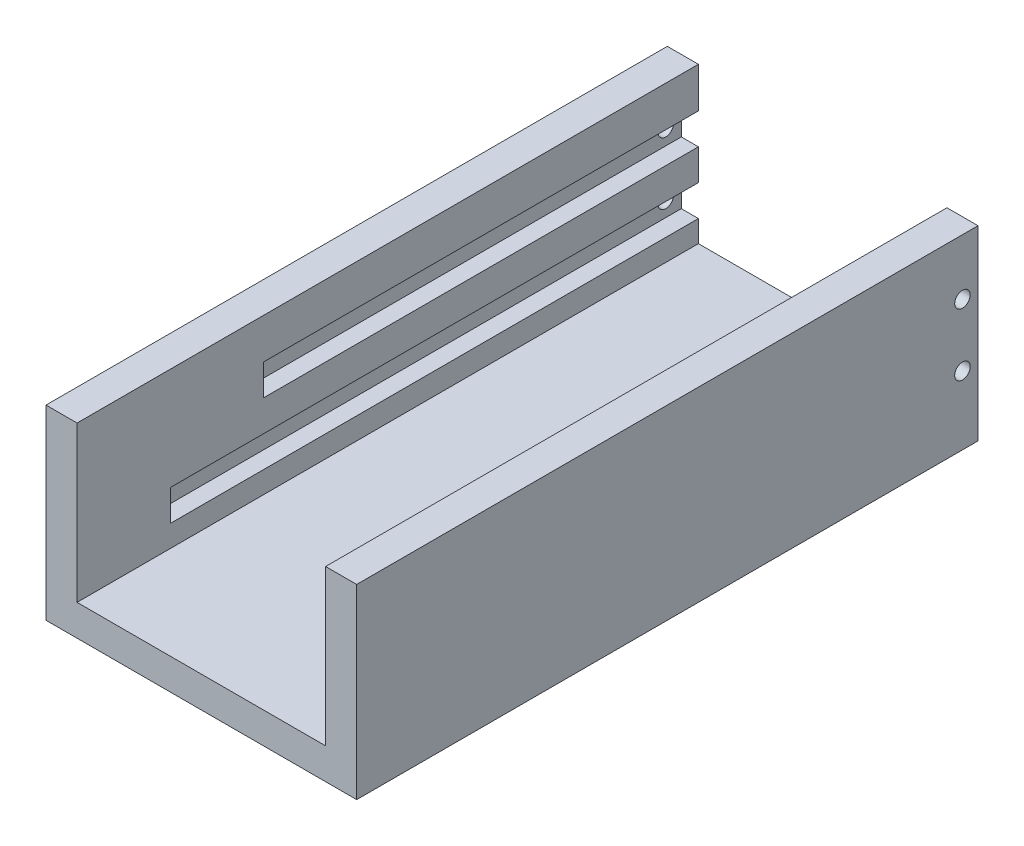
ISO-10303-21;
HEADER;
FILE_DESCRIPTION(('STEP AP214'),'2;1');
FILE_NAME('part.step','',(''),(''),'','','');
FILE_SCHEMA(('AUTOMOTIVE_DESIGN { 1 0 10303 214 1 1 1 1 }'));
ENDSEC;
DATA;
#1=APPLICATION_CONTEXT('core data for automotive mechanical design processes');
#2=APPLICATION_PROTOCOL_DEFINITION('international standard','automotive_design',2000,#1);
#3=PRODUCT_CONTEXT('',#1,'mechanical');
#4=PRODUCT('Part','Part','',(#3));
#5=PRODUCT_RELATED_PRODUCT_CATEGORY('part','',(#4));
#6=PRODUCT_DEFINITION_FORMATION('','',#4);
#7=PRODUCT_DEFINITION_CONTEXT('part definition',#1,'design');
#8=PRODUCT_DEFINITION('design','',#6,#7);
#9=PRODUCT_DEFINITION_SHAPE('','',#8);
#10=(LENGTH_UNIT() NAMED_UNIT(*) SI_UNIT(.MILLI.,.METRE.));
#11=(NAMED_UNIT(*) PLANE_ANGLE_UNIT() SI_UNIT($,.RADIAN.));
#12=(NAMED_UNIT(*) SI_UNIT($,.STERADIAN.) SOLID_ANGLE_UNIT());
#13=UNCERTAINTY_MEASURE_WITH_UNIT(LENGTH_MEASURE(1.E-05),#10,'distance_accuracy_value','');
#14=(GEOMETRIC_REPRESENTATION_CONTEXT(3) GLOBAL_UNCERTAINTY_ASSIGNED_CONTEXT((#13)) GLOBAL_UNIT_ASSIGNED_CONTEXT((#10,
#11,#12)) REPRESENTATION_CONTEXT('',''));
#15=CARTESIAN_POINT('',(0.,0.,0.));
#16=DIRECTION('',(0.,0.,1.));
#17=DIRECTION('',(1.,0.,0.));
#18=AXIS2_PLACEMENT_3D('',#15,#16,#17);
#19=CARTESIAN_POINT('',(40.,0.,200.));
#20=DIRECTION('',(1.,0.,0.));
#21=DIRECTION('',(0.,0.,-1.));
#22=AXIS2_PLACEMENT_3D('',#19,#20,#21);
#23=PLANE('',#22);
#24=DIRECTION('',(0.,0.,-1.));
#25=VECTOR('',#24,1.);
#26=CARTESIAN_POINT('',(40.,37.,0.));
#27=LINE('',#26,#25);
#28=CARTESIAN_POINT('',(40.,37.,140.));
#29=VERTEX_POINT('',#28);
#30=CARTESIAN_POINT('',(40.,37.,0.));
#31=VERTEX_POINT('',#30);
#32=EDGE_CURVE('E212',#29,#31,#27,.T.);
#33=ORIENTED_EDGE('',*,*,#32,.T.);
#34=DIRECTION('',(0.,1.,0.));
#35=VECTOR('',#34,1.);
#36=CARTESIAN_POINT('',(40.,0.,0.));
#37=LINE('',#36,#35);
#38=CARTESIAN_POINT('',(40.,27.,0.));
#39=VERTEX_POINT('',#38);
#40=EDGE_CURVE('E342',#31,#39,#37,.F.);
#41=ORIENTED_EDGE('',*,*,#40,.T.);
#42=DIRECTION('',(0.,0.,1.));
#43=VECTOR('',#42,1.);
#44=CARTESIAN_POINT('',(40.,27.,0.));
#45=LINE('',#44,#43);
#46=CARTESIAN_POINT('',(40.,27.,170.));
#47=VERTEX_POINT('',#46);
#48=EDGE_CURVE('E243',#39,#47,#45,.T.);
#49=ORIENTED_EDGE('',*,*,#48,.T.);
#50=DIRECTION('',(0.,-1.,0.));
#51=VECTOR('',#50,1.);
#52=CARTESIAN_POINT('',(40.,17.,170.));
#53=LINE('',#52,#51);
#54=CARTESIAN_POINT('',(40.,17.,170.));
#55=VERTEX_POINT('',#54);
#56=EDGE_CURVE('E240',#47,#55,#53,.T.);
#57=ORIENTED_EDGE('',*,*,#56,.T.);
#58=DIRECTION('',(0.,0.,-1.));
#59=VECTOR('',#58,1.);
#60=CARTESIAN_POINT('',(40.,17.,0.));
#61=LINE('',#60,#59);
#62=CARTESIAN_POINT('',(40.,17.,0.));
#63=VERTEX_POINT('',#62);
#64=EDGE_CURVE('E233',#55,#63,#61,.T.);
#65=ORIENTED_EDGE('',*,*,#64,.T.);
#66=CARTESIAN_POINT('',(40.,9.99999999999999,0.));
#67=VERTEX_POINT('',#66);
#68=EDGE_CURVE('E338',#63,#67,#37,.F.);
#69=ORIENTED_EDGE('',*,*,#68,.T.);
#70=DIRECTION('',(0.,0.,-1.));
#71=VECTOR('',#70,1.);
#72=CARTESIAN_POINT('',(40.,9.99999999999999,200.));
#73=LINE('',#72,#71);
#74=CARTESIAN_POINT('',(40.,9.99999999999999,200.));
#75=VERTEX_POINT('',#74);
#76=EDGE_CURVE('E368',#75,#67,#73,.T.);
#77=ORIENTED_EDGE('',*,*,#76,.F.);
#78=DIRECTION('',(0.,1.,0.));
#79=VECTOR('',#78,1.);
#80=CARTESIAN_POINT('',(40.,0.,200.));
#81=LINE('',#80,#79);
#82=CARTESIAN_POINT('',(40.,60.,200.));
#83=VERTEX_POINT('',#82);
#84=EDGE_CURVE('E361',#83,#75,#81,.F.);
#85=ORIENTED_EDGE('',*,*,#84,.F.);
#86=DIRECTION('',(0.,0.,-1.));
#87=VECTOR('',#86,1.);
#88=CARTESIAN_POINT('',(40.,60.,200.));
#89=LINE('',#88,#87);
#90=CARTESIAN_POINT('',(40.,60.,0.));
#91=VERTEX_POINT('',#90);
#92=EDGE_CURVE('E371',#83,#91,#89,.T.);
#93=ORIENTED_EDGE('',*,*,#92,.T.);
#94=CARTESIAN_POINT('',(40.,47.,0.));
#95=VERTEX_POINT('',#94);
#96=EDGE_CURVE('E339',#91,#95,#37,.F.);
#97=ORIENTED_EDGE('',*,*,#96,.T.);
#98=DIRECTION('',(0.,0.,1.));
#99=VECTOR('',#98,1.);
#100=CARTESIAN_POINT('',(40.,47.,0.));
#101=LINE('',#100,#99);
#102=CARTESIAN_POINT('',(40.,47.,140.));
#103=VERTEX_POINT('',#102);
#104=EDGE_CURVE('E221',#95,#103,#101,.T.);
#105=ORIENTED_EDGE('',*,*,#104,.T.);
#106=DIRECTION('',(0.,-1.,0.));
#107=VECTOR('',#106,1.);
#108=CARTESIAN_POINT('',(40.,37.,140.));
#109=LINE('',#108,#107);
#110=EDGE_CURVE('E202',#103,#29,#109,.T.);
#111=ORIENTED_EDGE('',*,*,#110,.T.);
#112=EDGE_LOOP('',(#33,#41,#49,#57,#65,#69,#77,#85,#93,#97,#105,#111));
#113=FACE_BOUND('',#112,.T.);
#114=ADVANCED_FACE('F33',(#113),#23,.F.);
#115=CARTESIAN_POINT('',(-40.,60.,0.));
#116=DIRECTION('',(0.,0.,-1.));
#117=DIRECTION('',(-1.,0.,0.));
#118=AXIS2_PLACEMENT_3D('',#115,#116,#117);
#119=PLANE('',#118);
#120=ORIENTED_EDGE('',*,*,#40,.F.);
#121=DIRECTION('',(-1.,0.,0.));
#122=VECTOR('',#121,1.);
#123=CARTESIAN_POINT('',(45.5,37.,0.));
#124=LINE('',#123,#122);
#125=CARTESIAN_POINT('',(45.5,37.,0.));
#126=VERTEX_POINT('',#125);
#127=EDGE_CURVE('E215',#126,#31,#124,.T.);
#128=ORIENTED_EDGE('',*,*,#127,.F.);
#129=DIRECTION('',(0.,1.,0.));
#130=VECTOR('',#129,1.);
#131=CARTESIAN_POINT('',(45.5,47.,0.));
#132=LINE('',#131,#130);
#133=CARTESIAN_POINT('',(45.5,47.,0.));
#134=VERTEX_POINT('',#133);
#135=EDGE_CURVE('E209',#126,#134,#132,.T.);
#136=ORIENTED_EDGE('',*,*,#135,.T.);
#137=DIRECTION('',(-1.,0.,0.));
#138=VECTOR('',#137,1.);
#139=CARTESIAN_POINT('',(45.5,47.,0.));
#140=LINE('',#139,#138);
#141=EDGE_CURVE('E234',#134,#95,#140,.T.);
#142=ORIENTED_EDGE('',*,*,#141,.T.);
#143=ORIENTED_EDGE('',*,*,#96,.F.);
#144=DIRECTION('',(1.,0.,0.));
#145=VECTOR('',#144,1.);
#146=CARTESIAN_POINT('',(40.,60.,0.));
#147=LINE('',#146,#145);
#148=CARTESIAN_POINT('',(50.,60.,0.));
#149=VERTEX_POINT('',#148);
#150=EDGE_CURVE('E335',#91,#149,#147,.T.);
#151=ORIENTED_EDGE('',*,*,#150,.T.);
#152=DIRECTION('',(0.,-1.,0.));
#153=VECTOR('',#152,1.);
#154=CARTESIAN_POINT('',(50.,0.,0.));
#155=LINE('',#154,#153);
#156=CARTESIAN_POINT('',(50.,0.,0.));
#157=VERTEX_POINT('',#156);
#158=EDGE_CURVE('E332',#149,#157,#155,.T.);
#159=ORIENTED_EDGE('',*,*,#158,.T.);
#160=DIRECTION('',(-1.,0.,0.));
#161=VECTOR('',#160,1.);
#162=CARTESIAN_POINT('',(50.,0.,0.));
#163=LINE('',#162,#161);
#164=CARTESIAN_POINT('',(-50.,0.,0.));
#165=VERTEX_POINT('',#164);
#166=EDGE_CURVE('E329',#157,#165,#163,.T.);
#167=ORIENTED_EDGE('',*,*,#166,.T.);
#168=DIRECTION('',(0.,1.,0.));
#169=VECTOR('',#168,1.);
#170=CARTESIAN_POINT('',(-50.,0.,0.));
#171=LINE('',#170,#169);
#172=CARTESIAN_POINT('',(-50.,60.,0.));
#173=VERTEX_POINT('',#172);
#174=EDGE_CURVE('E326',#165,#173,#171,.T.);
#175=ORIENTED_EDGE('',*,*,#174,.T.);
#176=DIRECTION('',(1.,0.,0.));
#177=VECTOR('',#176,1.);
#178=CARTESIAN_POINT('',(-50.,60.,0.));
#179=LINE('',#178,#177);
#180=CARTESIAN_POINT('',(-40.,60.,0.));
#181=VERTEX_POINT('',#180);
#182=EDGE_CURVE('E322',#173,#181,#179,.T.);
#183=ORIENTED_EDGE('',*,*,#182,.T.);
#184=DIRECTION('',(0.,1.,0.));
#185=VECTOR('',#184,1.);
#186=CARTESIAN_POINT('',(-40.,0.,0.));
#187=LINE('',#186,#185);
#188=CARTESIAN_POINT('',(-40.,47.,0.));
#189=VERTEX_POINT('',#188);
#190=EDGE_CURVE('E313',#189,#181,#187,.T.);
#191=ORIENTED_EDGE('',*,*,#190,.F.);
#192=DIRECTION('',(1.,0.,0.));
#193=VECTOR('',#192,1.);
#194=CARTESIAN_POINT('',(-45.5,47.,0.));
#195=LINE('',#194,#193);
#196=CARTESIAN_POINT('',(-45.5,47.,0.));
#197=VERTEX_POINT('',#196);
#198=EDGE_CURVE('E287',#197,#189,#195,.T.);
#199=ORIENTED_EDGE('',*,*,#198,.F.);
#200=DIRECTION('',(0.,1.,0.));
#201=VECTOR('',#200,1.);
#202=CARTESIAN_POINT('',(-45.5,47.,0.));
#203=LINE('',#202,#201);
#204=CARTESIAN_POINT('',(-45.5,37.,0.));
#205=VERTEX_POINT('',#204);
#206=EDGE_CURVE('E272',#205,#197,#203,.T.);
#207=ORIENTED_EDGE('',*,*,#206,.F.);
#208=DIRECTION('',(1.,0.,0.));
#209=VECTOR('',#208,1.);
#210=CARTESIAN_POINT('',(-45.5,37.,0.));
#211=LINE('',#210,#209);
#212=CARTESIAN_POINT('',(-40.,37.,0.));
#213=VERTEX_POINT('',#212);
#214=EDGE_CURVE('E281',#205,#213,#211,.T.);
#215=ORIENTED_EDGE('',*,*,#214,.T.);
#216=CARTESIAN_POINT('',(-40.,27.,0.));
#217=VERTEX_POINT('',#216);
#218=EDGE_CURVE('E323',#217,#213,#187,.T.);
#219=ORIENTED_EDGE('',*,*,#218,.F.);
#220=DIRECTION('',(1.,0.,0.));
#221=VECTOR('',#220,1.);
#222=CARTESIAN_POINT('',(-45.5,27.,0.));
#223=LINE('',#222,#221);
#224=CARTESIAN_POINT('',(-45.5,27.,0.));
#225=VERTEX_POINT('',#224);
#226=EDGE_CURVE('E309',#225,#217,#223,.T.);
#227=ORIENTED_EDGE('',*,*,#226,.F.);
#228=DIRECTION('',(0.,1.,0.));
#229=VECTOR('',#228,1.);
#230=CARTESIAN_POINT('',(-45.5,27.,0.));
#231=LINE('',#230,#229);
#232=CARTESIAN_POINT('',(-45.5,17.,0.));
#233=VERTEX_POINT('',#232);
#234=EDGE_CURVE('E298',#233,#225,#231,.T.);
#235=ORIENTED_EDGE('',*,*,#234,.F.);
#236=DIRECTION('',(1.,0.,0.));
#237=VECTOR('',#236,1.);
#238=CARTESIAN_POINT('',(-45.5,17.,0.));
#239=LINE('',#238,#237);
#240=CARTESIAN_POINT('',(-40.,17.,0.));
#241=VERTEX_POINT('',#240);
#242=EDGE_CURVE('E310',#233,#241,#239,.T.);
#243=ORIENTED_EDGE('',*,*,#242,.T.);
#244=CARTESIAN_POINT('',(-40.,9.99999999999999,0.));
#245=VERTEX_POINT('',#244);
#246=EDGE_CURVE('E319',#245,#241,#187,.T.);
#247=ORIENTED_EDGE('',*,*,#246,.F.);
#248=DIRECTION('',(1.,0.,0.));
#249=VECTOR('',#248,1.);
#250=CARTESIAN_POINT('',(50.,9.99999999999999,0.));
#251=LINE('',#250,#249);
#252=EDGE_CURVE('E341',#67,#245,#251,.F.);
#253=ORIENTED_EDGE('',*,*,#252,.F.);
#254=ORIENTED_EDGE('',*,*,#68,.F.);
#255=DIRECTION('',(-1.,0.,0.));
#256=VECTOR('',#255,1.);
#257=CARTESIAN_POINT('',(45.5,17.,0.));
#258=LINE('',#257,#256);
#259=CARTESIAN_POINT('',(45.5,17.,0.));
#260=VERTEX_POINT('',#259);
#261=EDGE_CURVE('E255',#260,#63,#258,.T.);
#262=ORIENTED_EDGE('',*,*,#261,.F.);
#263=DIRECTION('',(0.,1.,0.));
#264=VECTOR('',#263,1.);
#265=CARTESIAN_POINT('',(45.5,27.,0.));
#266=LINE('',#265,#264);
#267=CARTESIAN_POINT('',(45.5,27.,0.));
#268=VERTEX_POINT('',#267);
#269=EDGE_CURVE('E246',#260,#268,#266,.T.);
#270=ORIENTED_EDGE('',*,*,#269,.T.);
#271=DIRECTION('',(-1.,0.,0.));
#272=VECTOR('',#271,1.);
#273=CARTESIAN_POINT('',(45.5,27.,0.));
#274=LINE('',#273,#272);
#275=EDGE_CURVE('E58',#268,#39,#274,.T.);
#276=ORIENTED_EDGE('',*,*,#275,.T.);
#277=EDGE_LOOP('',(#120,#128,#136,#142,#143,#151,#159,#167,#175,#183,#191,#199,#207,#215,#219,
#227,#235,#243,#247,#253,#254,#262,#270,#276));
#278=FACE_BOUND('',#277,.T.);
#279=ADVANCED_FACE('F420',(#278),#119,.T.);
#280=CARTESIAN_POINT('',(-40.,0.,200.));
#281=DIRECTION('',(-1.,0.,0.));
#282=DIRECTION('',(0.,0.,1.));
#283=AXIS2_PLACEMENT_3D('',#280,#281,#282);
#284=PLANE('',#283);
#285=ORIENTED_EDGE('',*,*,#218,.T.);
#286=DIRECTION('',(0.,0.,-1.));
#287=VECTOR('',#286,1.);
#288=CARTESIAN_POINT('',(-40.,37.,0.));
#289=LINE('',#288,#287);
#290=CARTESIAN_POINT('',(-40.,37.,140.));
#291=VERTEX_POINT('',#290);
#292=EDGE_CURVE('E257',#291,#213,#289,.T.);
#293=ORIENTED_EDGE('',*,*,#292,.F.);
#294=DIRECTION('',(0.,-1.,0.));
#295=VECTOR('',#294,1.);
#296=CARTESIAN_POINT('',(-40.,37.,140.));
#297=LINE('',#296,#295);
#298=CARTESIAN_POINT('',(-40.,47.,140.));
#299=VERTEX_POINT('',#298);
#300=EDGE_CURVE('E267',#299,#291,#297,.T.);
#301=ORIENTED_EDGE('',*,*,#300,.F.);
#302=DIRECTION('',(0.,0.,1.));
#303=VECTOR('',#302,1.);
#304=CARTESIAN_POINT('',(-40.,47.,0.));
#305=LINE('',#304,#303);
#306=EDGE_CURVE('E264',#189,#299,#305,.T.);
#307=ORIENTED_EDGE('',*,*,#306,.F.);
#308=ORIENTED_EDGE('',*,*,#190,.T.);
#309=DIRECTION('',(0.,0.,-1.));
#310=VECTOR('',#309,1.);
#311=CARTESIAN_POINT('',(-40.,60.,200.));
#312=LINE('',#311,#310);
#313=CARTESIAN_POINT('',(-40.,60.,200.));
#314=VERTEX_POINT('',#313);
#315=EDGE_CURVE('E11',#314,#181,#312,.T.);
#316=ORIENTED_EDGE('',*,*,#315,.F.);
#317=DIRECTION('',(0.,1.,0.));
#318=VECTOR('',#317,1.);
#319=CARTESIAN_POINT('',(-40.,0.,200.));
#320=LINE('',#319,#318);
#321=CARTESIAN_POINT('',(-40.,9.99999999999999,200.));
#322=VERTEX_POINT('',#321);
#323=EDGE_CURVE('E344',#322,#314,#320,.T.);
#324=ORIENTED_EDGE('',*,*,#323,.F.);
#325=DIRECTION('',(0.,0.,-1.));
#326=VECTOR('',#325,1.);
#327=CARTESIAN_POINT('',(-40.,9.99999999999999,200.));
#328=LINE('',#327,#326);
#329=EDGE_CURVE('E365',#322,#245,#328,.T.);
#330=ORIENTED_EDGE('',*,*,#329,.T.);
#331=ORIENTED_EDGE('',*,*,#246,.T.);
#332=DIRECTION('',(0.,0.,-1.));
#333=VECTOR('',#332,1.);
#334=CARTESIAN_POINT('',(-40.,17.,0.));
#335=LINE('',#334,#333);
#336=CARTESIAN_POINT('',(-40.,17.,170.));
#337=VERTEX_POINT('',#336);
#338=EDGE_CURVE('E296',#337,#241,#335,.T.);
#339=ORIENTED_EDGE('',*,*,#338,.F.);
#340=DIRECTION('',(0.,-1.,0.));
#341=VECTOR('',#340,1.);
#342=CARTESIAN_POINT('',(-40.,17.,170.));
#343=LINE('',#342,#341);
#344=CARTESIAN_POINT('',(-40.,27.,170.));
#345=VERTEX_POINT('',#344);
#346=EDGE_CURVE('E293',#345,#337,#343,.T.);
#347=ORIENTED_EDGE('',*,*,#346,.F.);
#348=DIRECTION('',(0.,0.,1.));
#349=VECTOR('',#348,1.);
#350=CARTESIAN_POINT('',(-40.,27.,0.));
#351=LINE('',#350,#349);
#352=EDGE_CURVE('E284',#217,#345,#351,.T.);
#353=ORIENTED_EDGE('',*,*,#352,.F.);
#354=EDGE_LOOP('',(#285,#293,#301,#307,#308,#316,#324,#330,#331,#339,#347,#353));
#355=FACE_BOUND('',#354,.T.);
#356=ADVANCED_FACE('F35',(#355),#284,.F.);
#357=CARTESIAN_POINT('',(-50.,60.,200.));
#358=DIRECTION('',(0.,1.,0.));
#359=DIRECTION('',(0.,0.,1.));
#360=AXIS2_PLACEMENT_3D('',#357,#358,#359);
#361=PLANE('',#360);
#362=ORIENTED_EDGE('',*,*,#182,.F.);
#363=DIRECTION('',(0.,0.,-1.));
#364=VECTOR('',#363,1.);
#365=CARTESIAN_POINT('',(-50.,60.,200.));
#366=LINE('',#365,#364);
#367=CARTESIAN_POINT('',(-50.,60.,200.));
#368=VERTEX_POINT('',#367);
#369=EDGE_CURVE('E42',#368,#173,#366,.T.);
#370=ORIENTED_EDGE('',*,*,#369,.F.);
#371=DIRECTION('',(1.,0.,0.));
#372=VECTOR('',#371,1.);
#373=CARTESIAN_POINT('',(-50.,60.,200.));
#374=LINE('',#373,#372);
#375=EDGE_CURVE('E346',#368,#314,#374,.T.);
#376=ORIENTED_EDGE('',*,*,#375,.T.);
#377=ORIENTED_EDGE('',*,*,#315,.T.);
#378=EDGE_LOOP('',(#362,#370,#376,#377));
#379=FACE_BOUND('',#378,.T.);
#380=ADVANCED_FACE('F437',(#379),#361,.T.);
#381=CARTESIAN_POINT('',(-50.,0.,200.));
#382=DIRECTION('',(-1.,0.,0.));
#383=DIRECTION('',(0.,0.,1.));
#384=AXIS2_PLACEMENT_3D('',#381,#382,#383);
#385=PLANE('',#384);
#386=CARTESIAN_POINT('',(-50.,22.,5.));
#387=DIRECTION('',(1.,0.,0.));
#388=DIRECTION('',(0.,0.,-1.));
#389=AXIS2_PLACEMENT_3D('',#386,#387,#388);
#390=CIRCLE('',#389,2.5);
#391=CARTESIAN_POINT('',(-50.,22.,2.5));
#392=VERTEX_POINT('',#391);
#393=EDGE_CURVE('E396',#392,#392,#390,.T.);
#394=ORIENTED_EDGE('',*,*,#393,.T.);
#395=EDGE_LOOP('',(#394));
#396=FACE_BOUND('',#395,.T.);
#397=CARTESIAN_POINT('',(-50.,42.,5.));
#398=DIRECTION('',(1.,0.,0.));
#399=DIRECTION('',(0.,0.,-1.));
#400=AXIS2_PLACEMENT_3D('',#397,#398,#399);
#401=CIRCLE('',#400,2.5);
#402=CARTESIAN_POINT('',(-50.,42.,2.5));
#403=VERTEX_POINT('',#402);
#404=EDGE_CURVE('E381',#403,#403,#401,.T.);
#405=ORIENTED_EDGE('',*,*,#404,.T.);
#406=EDGE_LOOP('',(#405));
#407=FACE_BOUND('',#406,.T.);
#408=ORIENTED_EDGE('',*,*,#174,.F.);
#409=DIRECTION('',(0.,0.,-1.));
#410=VECTOR('',#409,1.);
#411=CARTESIAN_POINT('',(-50.,0.,200.));
#412=LINE('',#411,#410);
#413=CARTESIAN_POINT('',(-50.,0.,200.));
#414=VERTEX_POINT('',#413);
#415=EDGE_CURVE('E377',#414,#165,#412,.T.);
#416=ORIENTED_EDGE('',*,*,#415,.F.);
#417=DIRECTION('',(0.,1.,0.));
#418=VECTOR('',#417,1.);
#419=CARTESIAN_POINT('',(-50.,0.,200.));
#420=LINE('',#419,#418);
#421=EDGE_CURVE('E349',#414,#368,#420,.T.);
#422=ORIENTED_EDGE('',*,*,#421,.T.);
#423=ORIENTED_EDGE('',*,*,#369,.T.);
#424=EDGE_LOOP('',(#408,#416,#422,#423));
#425=FACE_BOUND('',#424,.T.);
#426=ADVANCED_FACE('F435',(#396,#407,#425),#385,.T.);
#427=CARTESIAN_POINT('',(50.,0.,200.));
#428=DIRECTION('',(0.,-1.,0.));
#429=DIRECTION('',(0.,0.,-1.));
#430=AXIS2_PLACEMENT_3D('',#427,#428,#429);
#431=PLANE('',#430);
#432=ORIENTED_EDGE('',*,*,#166,.F.);
#433=DIRECTION('',(0.,0.,-1.));
#434=VECTOR('',#433,1.);
#435=CARTESIAN_POINT('',(50.,0.,200.));
#436=LINE('',#435,#434);
#437=CARTESIAN_POINT('',(50.,0.,200.));
#438=VERTEX_POINT('',#437);
#439=EDGE_CURVE('E375',#438,#157,#436,.T.);
#440=ORIENTED_EDGE('',*,*,#439,.F.);
#441=DIRECTION('',(-1.,0.,0.));
#442=VECTOR('',#441,1.);
#443=CARTESIAN_POINT('',(50.,0.,200.));
#444=LINE('',#443,#442);
#445=EDGE_CURVE('E352',#438,#414,#444,.T.);
#446=ORIENTED_EDGE('',*,*,#445,.T.);
#447=ORIENTED_EDGE('',*,*,#415,.T.);
#448=EDGE_LOOP('',(#432,#440,#446,#447));
#449=FACE_BOUND('',#448,.T.);
#450=ADVANCED_FACE('F410',(#449),#431,.T.);
#451=CARTESIAN_POINT('',(50.,0.,200.));
#452=DIRECTION('',(1.,0.,0.));
#453=DIRECTION('',(0.,0.,-1.));
#454=AXIS2_PLACEMENT_3D('',#451,#452,#453);
#455=PLANE('',#454);
#456=CARTESIAN_POINT('',(50.,22.,5.));
#457=DIRECTION('',(1.,0.,0.));
#458=DIRECTION('',(0.,0.,-1.));
#459=AXIS2_PLACEMENT_3D('',#456,#457,#458);
#460=CIRCLE('',#459,2.5);
#461=CARTESIAN_POINT('',(50.,22.,2.5));
#462=VERTEX_POINT('',#461);
#463=EDGE_CURVE('E399',#462,#462,#460,.T.);
#464=ORIENTED_EDGE('',*,*,#463,.F.);
#465=EDGE_LOOP('',(#464));
#466=FACE_BOUND('',#465,.T.);
#467=CARTESIAN_POINT('',(50.,42.,5.));
#468=DIRECTION('',(1.,0.,0.));
#469=DIRECTION('',(0.,0.,-1.));
#470=AXIS2_PLACEMENT_3D('',#467,#468,#469);
#471=CIRCLE('',#470,2.5);
#472=CARTESIAN_POINT('',(50.,42.,2.5));
#473=VERTEX_POINT('',#472);
#474=EDGE_CURVE('E386',#473,#473,#471,.T.);
#475=ORIENTED_EDGE('',*,*,#474,.F.);
#476=EDGE_LOOP('',(#475));
#477=FACE_BOUND('',#476,.T.);
#478=ORIENTED_EDGE('',*,*,#158,.F.);
#479=DIRECTION('',(0.,0.,-1.));
#480=VECTOR('',#479,1.);
#481=CARTESIAN_POINT('',(50.,60.,200.));
#482=LINE('',#481,#480);
#483=CARTESIAN_POINT('',(50.,60.,200.));
#484=VERTEX_POINT('',#483);
#485=EDGE_CURVE('E373',#484,#149,#482,.T.);
#486=ORIENTED_EDGE('',*,*,#485,.F.);
#487=DIRECTION('',(0.,-1.,0.));
#488=VECTOR('',#487,1.);
#489=CARTESIAN_POINT('',(50.,0.,200.));
#490=LINE('',#489,#488);
#491=EDGE_CURVE('E355',#484,#438,#490,.T.);
#492=ORIENTED_EDGE('',*,*,#491,.T.);
#493=ORIENTED_EDGE('',*,*,#439,.T.);
#494=EDGE_LOOP('',(#478,#486,#492,#493));
#495=FACE_BOUND('',#494,.T.);
#496=ADVANCED_FACE('F406',(#466,#477,#495),#455,.T.);
#497=CARTESIAN_POINT('',(40.,60.,200.));
#498=DIRECTION('',(0.,1.,0.));
#499=DIRECTION('',(0.,0.,1.));
#500=AXIS2_PLACEMENT_3D('',#497,#498,#499);
#501=PLANE('',#500);
#502=ORIENTED_EDGE('',*,*,#150,.F.);
#503=ORIENTED_EDGE('',*,*,#92,.F.);
#504=DIRECTION('',(1.,0.,0.));
#505=VECTOR('',#504,1.);
#506=CARTESIAN_POINT('',(40.,60.,200.));
#507=LINE('',#506,#505);
#508=EDGE_CURVE('E358',#83,#484,#507,.T.);
#509=ORIENTED_EDGE('',*,*,#508,.T.);
#510=ORIENTED_EDGE('',*,*,#485,.T.);
#511=EDGE_LOOP('',(#502,#503,#509,#510));
#512=FACE_BOUND('',#511,.T.);
#513=ADVANCED_FACE('F409',(#512),#501,.T.);
#514=CARTESIAN_POINT('',(50.,9.99999999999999,200.));
#515=DIRECTION('',(0.,-1.,0.));
#516=DIRECTION('',(0.,0.,-1.));
#517=AXIS2_PLACEMENT_3D('',#514,#515,#516);
#518=PLANE('',#517);
#519=ORIENTED_EDGE('',*,*,#252,.T.);
#520=ORIENTED_EDGE('',*,*,#329,.F.);
#521=DIRECTION('',(1.,0.,0.));
#522=VECTOR('',#521,1.);
#523=CARTESIAN_POINT('',(50.,9.99999999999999,200.));
#524=LINE('',#523,#522);
#525=EDGE_CURVE('E363',#75,#322,#524,.F.);
#526=ORIENTED_EDGE('',*,*,#525,.F.);
#527=ORIENTED_EDGE('',*,*,#76,.T.);
#528=EDGE_LOOP('',(#519,#520,#526,#527));
#529=FACE_BOUND('',#528,.T.);
#530=ADVANCED_FACE('F485',(#529),#518,.F.);
#531=CARTESIAN_POINT('',(-40.,60.,200.));
#532=DIRECTION('',(0.,0.,-1.));
#533=DIRECTION('',(-1.,0.,0.));
#534=AXIS2_PLACEMENT_3D('',#531,#532,#533);
#535=PLANE('',#534);
#536=ORIENTED_EDGE('',*,*,#323,.T.);
#537=ORIENTED_EDGE('',*,*,#375,.F.);
#538=ORIENTED_EDGE('',*,*,#421,.F.);
#539=ORIENTED_EDGE('',*,*,#445,.F.);
#540=ORIENTED_EDGE('',*,*,#491,.F.);
#541=ORIENTED_EDGE('',*,*,#508,.F.);
#542=ORIENTED_EDGE('',*,*,#84,.T.);
#543=ORIENTED_EDGE('',*,*,#525,.T.);
#544=EDGE_LOOP('',(#536,#537,#538,#539,#540,#541,#542,#543));
#545=FACE_BOUND('',#544,.T.);
#546=ADVANCED_FACE('F425',(#545),#535,.F.);
#547=CARTESIAN_POINT('',(-45.5,17.,0.));
#548=DIRECTION('',(0.,-1.,0.));
#549=DIRECTION('',(0.,0.,-1.));
#550=AXIS2_PLACEMENT_3D('',#547,#548,#549);
#551=PLANE('',#550);
#552=ORIENTED_EDGE('',*,*,#338,.T.);
#553=ORIENTED_EDGE('',*,*,#242,.F.);
#554=DIRECTION('',(0.,0.,-1.));
#555=VECTOR('',#554,1.);
#556=CARTESIAN_POINT('',(-45.5,17.,0.));
#557=LINE('',#556,#555);
#558=CARTESIAN_POINT('',(-45.5,17.,170.));
#559=VERTEX_POINT('',#558);
#560=EDGE_CURVE('E307',#559,#233,#557,.T.);
#561=ORIENTED_EDGE('',*,*,#560,.F.);
#562=DIRECTION('',(1.,0.,0.));
#563=VECTOR('',#562,1.);
#564=CARTESIAN_POINT('',(-45.5,17.,170.));
#565=LINE('',#564,#563);
#566=EDGE_CURVE('E314',#559,#337,#565,.T.);
#567=ORIENTED_EDGE('',*,*,#566,.T.);
#568=EDGE_LOOP('',(#552,#553,#561,#567));
#569=FACE_BOUND('',#568,.T.);
#570=ADVANCED_FACE('F679',(#569),#551,.F.);
#571=CARTESIAN_POINT('',(-45.5,17.,170.));
#572=DIRECTION('',(0.,0.,1.));
#573=DIRECTION('',(1.,0.,0.));
#574=AXIS2_PLACEMENT_3D('',#571,#572,#573);
#575=PLANE('',#574);
#576=ORIENTED_EDGE('',*,*,#346,.T.);
#577=ORIENTED_EDGE('',*,*,#566,.F.);
#578=DIRECTION('',(0.,-1.,0.));
#579=VECTOR('',#578,1.);
#580=CARTESIAN_POINT('',(-45.5,17.,170.));
#581=LINE('',#580,#579);
#582=CARTESIAN_POINT('',(-45.5,27.,170.));
#583=VERTEX_POINT('',#582);
#584=EDGE_CURVE('E304',#583,#559,#581,.T.);
#585=ORIENTED_EDGE('',*,*,#584,.F.);
#586=DIRECTION('',(1.,0.,0.));
#587=VECTOR('',#586,1.);
#588=CARTESIAN_POINT('',(-45.5,27.,170.));
#589=LINE('',#588,#587);
#590=EDGE_CURVE('E316',#583,#345,#589,.T.);
#591=ORIENTED_EDGE('',*,*,#590,.T.);
#592=EDGE_LOOP('',(#576,#577,#585,#591));
#593=FACE_BOUND('',#592,.T.);
#594=ADVANCED_FACE('F682',(#593),#575,.F.);
#595=CARTESIAN_POINT('',(-45.5,27.,0.));
#596=DIRECTION('',(0.,1.,0.));
#597=DIRECTION('',(0.,0.,1.));
#598=AXIS2_PLACEMENT_3D('',#595,#596,#597);
#599=PLANE('',#598);
#600=ORIENTED_EDGE('',*,*,#352,.T.);
#601=ORIENTED_EDGE('',*,*,#590,.F.);
#602=DIRECTION('',(0.,0.,1.));
#603=VECTOR('',#602,1.);
#604=CARTESIAN_POINT('',(-45.5,27.,0.));
#605=LINE('',#604,#603);
#606=EDGE_CURVE('E301',#225,#583,#605,.T.);
#607=ORIENTED_EDGE('',*,*,#606,.F.);
#608=ORIENTED_EDGE('',*,*,#226,.T.);
#609=EDGE_LOOP('',(#600,#601,#607,#608));
#610=FACE_BOUND('',#609,.T.);
#611=ADVANCED_FACE('F589',(#610),#599,.F.);
#612=CARTESIAN_POINT('',(-45.5,17.,0.));
#613=DIRECTION('',(-1.,0.,0.));
#614=DIRECTION('',(0.,0.,1.));
#615=AXIS2_PLACEMENT_3D('',#612,#613,#614);
#616=PLANE('',#615);
#617=CARTESIAN_POINT('',(-45.5,22.,5.));
#618=DIRECTION('',(-1.,0.,0.));
#619=DIRECTION('',(0.,0.,1.));
#620=AXIS2_PLACEMENT_3D('',#617,#618,#619);
#621=CIRCLE('',#620,2.5);
#622=CARTESIAN_POINT('',(-45.5,22.,7.5));
#623=VERTEX_POINT('',#622);
#624=EDGE_CURVE('E391',#623,#623,#621,.T.);
#625=ORIENTED_EDGE('',*,*,#624,.T.);
#626=EDGE_LOOP('',(#625));
#627=FACE_BOUND('',#626,.T.);
#628=ORIENTED_EDGE('',*,*,#234,.T.);
#629=ORIENTED_EDGE('',*,*,#606,.T.);
#630=ORIENTED_EDGE('',*,*,#584,.T.);
#631=ORIENTED_EDGE('',*,*,#560,.T.);
#632=EDGE_LOOP('',(#628,#629,#630,#631));
#633=FACE_BOUND('',#632,.T.);
#634=ADVANCED_FACE('F585',(#627,#633),#616,.F.);
#635=CARTESIAN_POINT('',(-45.5,37.,0.));
#636=DIRECTION('',(0.,-1.,0.));
#637=DIRECTION('',(0.,0.,-1.));
#638=AXIS2_PLACEMENT_3D('',#635,#636,#637);
#639=PLANE('',#638);
#640=ORIENTED_EDGE('',*,*,#292,.T.);
#641=ORIENTED_EDGE('',*,*,#214,.F.);
#642=DIRECTION('',(0.,0.,-1.));
#643=VECTOR('',#642,1.);
#644=CARTESIAN_POINT('',(-45.5,37.,0.));
#645=LINE('',#644,#643);
#646=CARTESIAN_POINT('',(-45.5,37.,140.));
#647=VERTEX_POINT('',#646);
#648=EDGE_CURVE('E270',#647,#205,#645,.T.);
#649=ORIENTED_EDGE('',*,*,#648,.F.);
#650=DIRECTION('',(1.,0.,0.));
#651=VECTOR('',#650,1.);
#652=CARTESIAN_POINT('',(-45.5,37.,140.));
#653=LINE('',#652,#651);
#654=EDGE_CURVE('E282',#647,#291,#653,.T.);
#655=ORIENTED_EDGE('',*,*,#654,.T.);
#656=EDGE_LOOP('',(#640,#641,#649,#655));
#657=FACE_BOUND('',#656,.T.);
#658=ADVANCED_FACE('F455',(#657),#639,.F.);
#659=CARTESIAN_POINT('',(-45.5,37.,140.));
#660=DIRECTION('',(0.,0.,1.));
#661=DIRECTION('',(1.,0.,0.));
#662=AXIS2_PLACEMENT_3D('',#659,#660,#661);
#663=PLANE('',#662);
#664=ORIENTED_EDGE('',*,*,#300,.T.);
#665=ORIENTED_EDGE('',*,*,#654,.F.);
#666=DIRECTION('',(0.,-1.,0.));
#667=VECTOR('',#666,1.);
#668=CARTESIAN_POINT('',(-45.5,37.,140.));
#669=LINE('',#668,#667);
#670=CARTESIAN_POINT('',(-45.5,47.,140.));
#671=VERTEX_POINT('',#670);
#672=EDGE_CURVE('E278',#671,#647,#669,.T.);
#673=ORIENTED_EDGE('',*,*,#672,.F.);
#674=DIRECTION('',(1.,0.,0.));
#675=VECTOR('',#674,1.);
#676=CARTESIAN_POINT('',(-45.5,47.,140.));
#677=LINE('',#676,#675);
#678=EDGE_CURVE('E285',#671,#299,#677,.T.);
#679=ORIENTED_EDGE('',*,*,#678,.T.);
#680=EDGE_LOOP('',(#664,#665,#673,#679));
#681=FACE_BOUND('',#680,.T.);
#682=ADVANCED_FACE('F458',(#681),#663,.F.);
#683=CARTESIAN_POINT('',(-45.5,47.,0.));
#684=DIRECTION('',(0.,1.,0.));
#685=DIRECTION('',(0.,0.,1.));
#686=AXIS2_PLACEMENT_3D('',#683,#684,#685);
#687=PLANE('',#686);
#688=ORIENTED_EDGE('',*,*,#306,.T.);
#689=ORIENTED_EDGE('',*,*,#678,.F.);
#690=DIRECTION('',(0.,0.,1.));
#691=VECTOR('',#690,1.);
#692=CARTESIAN_POINT('',(-45.5,47.,0.));
#693=LINE('',#692,#691);
#694=EDGE_CURVE('E275',#197,#671,#693,.T.);
#695=ORIENTED_EDGE('',*,*,#694,.F.);
#696=ORIENTED_EDGE('',*,*,#198,.T.);
#697=EDGE_LOOP('',(#688,#689,#695,#696));
#698=FACE_BOUND('',#697,.T.);
#699=ADVANCED_FACE('F460',(#698),#687,.F.);
#700=CARTESIAN_POINT('',(-45.5,37.,0.));
#701=DIRECTION('',(1.,0.,0.));
#702=DIRECTION('',(0.,0.,-1.));
#703=AXIS2_PLACEMENT_3D('',#700,#701,#702);
#704=PLANE('',#703);
#705=CARTESIAN_POINT('',(-45.5,42.,5.));
#706=DIRECTION('',(1.,0.,0.));
#707=DIRECTION('',(0.,0.,-1.));
#708=AXIS2_PLACEMENT_3D('',#705,#706,#707);
#709=CIRCLE('',#708,2.5);
#710=CARTESIAN_POINT('',(-45.5,42.,2.5));
#711=VERTEX_POINT('',#710);
#712=EDGE_CURVE('E218',#711,#711,#709,.T.);
#713=ORIENTED_EDGE('',*,*,#712,.F.);
#714=EDGE_LOOP('',(#713));
#715=FACE_BOUND('',#714,.T.);
#716=ORIENTED_EDGE('',*,*,#648,.T.);
#717=ORIENTED_EDGE('',*,*,#206,.T.);
#718=ORIENTED_EDGE('',*,*,#694,.T.);
#719=ORIENTED_EDGE('',*,*,#672,.T.);
#720=EDGE_LOOP('',(#716,#717,#718,#719));
#721=FACE_BOUND('',#720,.T.);
#722=ADVANCED_FACE('F462',(#715,#721),#704,.T.);
#723=CARTESIAN_POINT('',(45.5,27.,0.));
#724=DIRECTION('',(0.,-1.,0.));
#725=DIRECTION('',(0.,0.,-1.));
#726=AXIS2_PLACEMENT_3D('',#723,#724,#725);
#727=PLANE('',#726);
#728=ORIENTED_EDGE('',*,*,#48,.F.);
#729=ORIENTED_EDGE('',*,*,#275,.F.);
#730=DIRECTION('',(0.,0.,1.));
#731=VECTOR('',#730,1.);
#732=CARTESIAN_POINT('',(45.5,27.,0.));
#733=LINE('',#732,#731);
#734=CARTESIAN_POINT('',(45.5,27.,170.));
#735=VERTEX_POINT('',#734);
#736=EDGE_CURVE('E253',#268,#735,#733,.T.);
#737=ORIENTED_EDGE('',*,*,#736,.T.);
#738=DIRECTION('',(-1.,0.,0.));
#739=VECTOR('',#738,1.);
#740=CARTESIAN_POINT('',(45.5,27.,170.));
#741=LINE('',#740,#739);
#742=EDGE_CURVE('E258',#735,#47,#741,.T.);
#743=ORIENTED_EDGE('',*,*,#742,.T.);
#744=EDGE_LOOP('',(#728,#729,#737,#743));
#745=FACE_BOUND('',#744,.T.);
#746=ADVANCED_FACE('F464',(#745),#727,.T.);
#747=CARTESIAN_POINT('',(45.5,17.,170.));
#748=DIRECTION('',(0.,0.,-1.));
#749=DIRECTION('',(-1.,0.,0.));
#750=AXIS2_PLACEMENT_3D('',#747,#748,#749);
#751=PLANE('',#750);
#752=ORIENTED_EDGE('',*,*,#56,.F.);
#753=ORIENTED_EDGE('',*,*,#742,.F.);
#754=DIRECTION('',(0.,-1.,0.));
#755=VECTOR('',#754,1.);
#756=CARTESIAN_POINT('',(45.5,17.,170.));
#757=LINE('',#756,#755);
#758=CARTESIAN_POINT('',(45.5,17.,170.));
#759=VERTEX_POINT('',#758);
#760=EDGE_CURVE('E251',#735,#759,#757,.T.);
#761=ORIENTED_EDGE('',*,*,#760,.T.);
#762=DIRECTION('',(-1.,0.,0.));
#763=VECTOR('',#762,1.);
#764=CARTESIAN_POINT('',(45.5,17.,170.));
#765=LINE('',#764,#763);
#766=EDGE_CURVE('E260',#759,#55,#765,.T.);
#767=ORIENTED_EDGE('',*,*,#766,.T.);
#768=EDGE_LOOP('',(#752,#753,#761,#767));
#769=FACE_BOUND('',#768,.T.);
#770=ADVANCED_FACE('F471',(#769),#751,.T.);
#771=CARTESIAN_POINT('',(45.5,17.,0.));
#772=DIRECTION('',(0.,1.,0.));
#773=DIRECTION('',(0.,0.,1.));
#774=AXIS2_PLACEMENT_3D('',#771,#772,#773);
#775=PLANE('',#774);
#776=ORIENTED_EDGE('',*,*,#64,.F.);
#777=ORIENTED_EDGE('',*,*,#766,.F.);
#778=DIRECTION('',(0.,0.,-1.));
#779=VECTOR('',#778,1.);
#780=CARTESIAN_POINT('',(45.5,17.,0.));
#781=LINE('',#780,#779);
#782=EDGE_CURVE('E249',#759,#260,#781,.T.);
#783=ORIENTED_EDGE('',*,*,#782,.T.);
#784=ORIENTED_EDGE('',*,*,#261,.T.);
#785=EDGE_LOOP('',(#776,#777,#783,#784));
#786=FACE_BOUND('',#785,.T.);
#787=ADVANCED_FACE('F524',(#786),#775,.T.);
#788=CARTESIAN_POINT('',(45.5,17.,0.));
#789=DIRECTION('',(1.,0.,0.));
#790=DIRECTION('',(0.,0.,1.));
#791=AXIS2_PLACEMENT_3D('',#788,#789,#790);
#792=PLANE('',#791);
#793=CARTESIAN_POINT('',(45.5,22.,5.));
#794=DIRECTION('',(1.,0.,0.));
#795=DIRECTION('',(0.,0.,-1.));
#796=AXIS2_PLACEMENT_3D('',#793,#794,#795);
#797=CIRCLE('',#796,2.5);
#798=CARTESIAN_POINT('',(45.5,22.,2.5));
#799=VERTEX_POINT('',#798);
#800=EDGE_CURVE('E37',#799,#799,#797,.T.);
#801=ORIENTED_EDGE('',*,*,#800,.T.);
#802=EDGE_LOOP('',(#801));
#803=FACE_BOUND('',#802,.T.);
#804=ORIENTED_EDGE('',*,*,#269,.F.);
#805=ORIENTED_EDGE('',*,*,#782,.F.);
#806=ORIENTED_EDGE('',*,*,#760,.F.);
#807=ORIENTED_EDGE('',*,*,#736,.F.);
#808=EDGE_LOOP('',(#804,#805,#806,#807));
#809=FACE_BOUND('',#808,.T.);
#810=ADVANCED_FACE('F534',(#803,#809),#792,.F.);
#811=CARTESIAN_POINT('',(45.5,37.,0.));
#812=DIRECTION('',(0.,1.,0.));
#813=DIRECTION('',(0.,0.,1.));
#814=AXIS2_PLACEMENT_3D('',#811,#812,#813);
#815=PLANE('',#814);
#816=ORIENTED_EDGE('',*,*,#32,.F.);
#817=DIRECTION('',(-1.,0.,0.));
#818=VECTOR('',#817,1.);
#819=CARTESIAN_POINT('',(45.5,37.,140.));
#820=LINE('',#819,#818);
#821=CARTESIAN_POINT('',(45.5,37.,140.));
#822=VERTEX_POINT('',#821);
#823=EDGE_CURVE('E197',#822,#29,#820,.T.);
#824=ORIENTED_EDGE('',*,*,#823,.F.);
#825=DIRECTION('',(0.,0.,-1.));
#826=VECTOR('',#825,1.);
#827=CARTESIAN_POINT('',(45.5,37.,0.));
#828=LINE('',#827,#826);
#829=EDGE_CURVE('E223',#822,#126,#828,.T.);
#830=ORIENTED_EDGE('',*,*,#829,.T.);
#831=ORIENTED_EDGE('',*,*,#127,.T.);
#832=EDGE_LOOP('',(#816,#824,#830,#831));
#833=FACE_BOUND('',#832,.T.);
#834=ADVANCED_FACE('F213',(#833),#815,.T.);
#835=CARTESIAN_POINT('',(45.5,47.,0.));
#836=DIRECTION('',(0.,-1.,0.));
#837=DIRECTION('',(0.,0.,-1.));
#838=AXIS2_PLACEMENT_3D('',#835,#836,#837);
#839=PLANE('',#838);
#840=ORIENTED_EDGE('',*,*,#104,.F.);
#841=ORIENTED_EDGE('',*,*,#141,.F.);
#842=DIRECTION('',(0.,0.,1.));
#843=VECTOR('',#842,1.);
#844=CARTESIAN_POINT('',(45.5,47.,0.));
#845=LINE('',#844,#843);
#846=CARTESIAN_POINT('',(45.5,47.,140.));
#847=VERTEX_POINT('',#846);
#848=EDGE_CURVE('E50',#134,#847,#845,.T.);
#849=ORIENTED_EDGE('',*,*,#848,.T.);
#850=DIRECTION('',(-1.,0.,0.));
#851=VECTOR('',#850,1.);
#852=CARTESIAN_POINT('',(45.5,47.,140.));
#853=LINE('',#852,#851);
#854=EDGE_CURVE('E208',#847,#103,#853,.T.);
#855=ORIENTED_EDGE('',*,*,#854,.T.);
#856=EDGE_LOOP('',(#840,#841,#849,#855));
#857=FACE_BOUND('',#856,.T.);
#858=ADVANCED_FACE('F545',(#857),#839,.T.);
#859=CARTESIAN_POINT('',(45.5,37.,140.));
#860=DIRECTION('',(0.,0.,-1.));
#861=DIRECTION('',(-1.,0.,0.));
#862=AXIS2_PLACEMENT_3D('',#859,#860,#861);
#863=PLANE('',#862);
#864=ORIENTED_EDGE('',*,*,#110,.F.);
#865=ORIENTED_EDGE('',*,*,#854,.F.);
#866=DIRECTION('',(0.,-1.,0.));
#867=VECTOR('',#866,1.);
#868=CARTESIAN_POINT('',(45.5,37.,140.));
#869=LINE('',#868,#867);
#870=EDGE_CURVE('E204',#847,#822,#869,.T.);
#871=ORIENTED_EDGE('',*,*,#870,.T.);
#872=ORIENTED_EDGE('',*,*,#823,.T.);
#873=EDGE_LOOP('',(#864,#865,#871,#872));
#874=FACE_BOUND('',#873,.T.);
#875=ADVANCED_FACE('F199',(#874),#863,.T.);
#876=CARTESIAN_POINT('',(45.5,37.,0.));
#877=DIRECTION('',(-1.,0.,0.));
#878=DIRECTION('',(0.,0.,-1.));
#879=AXIS2_PLACEMENT_3D('',#876,#877,#878);
#880=PLANE('',#879);
#881=CARTESIAN_POINT('',(45.5,42.,5.));
#882=DIRECTION('',(-1.,0.,0.));
#883=DIRECTION('',(0.,0.,1.));
#884=AXIS2_PLACEMENT_3D('',#881,#882,#883);
#885=CIRCLE('',#884,2.5);
#886=CARTESIAN_POINT('',(45.5,42.,7.5));
#887=VERTEX_POINT('',#886);
#888=EDGE_CURVE('E379',#887,#887,#885,.T.);
#889=ORIENTED_EDGE('',*,*,#888,.F.);
#890=EDGE_LOOP('',(#889));
#891=FACE_BOUND('',#890,.T.);
#892=ORIENTED_EDGE('',*,*,#829,.F.);
#893=ORIENTED_EDGE('',*,*,#870,.F.);
#894=ORIENTED_EDGE('',*,*,#848,.F.);
#895=ORIENTED_EDGE('',*,*,#135,.F.);
#896=EDGE_LOOP('',(#892,#893,#894,#895));
#897=FACE_BOUND('',#896,.T.);
#898=ADVANCED_FACE('F563',(#891,#897),#880,.T.);
#899=CARTESIAN_POINT('',(-50.,42.,5.));
#900=DIRECTION('',(1.,0.,0.));
#901=DIRECTION('',(0.,0.,-1.));
#902=AXIS2_PLACEMENT_3D('',#899,#900,#901);
#903=CYLINDRICAL_SURFACE('',#902,2.5);
#904=ORIENTED_EDGE('',*,*,#888,.T.);
#905=EDGE_LOOP('',(#904));
#906=FACE_BOUND('',#905,.T.);
#907=ORIENTED_EDGE('',*,*,#474,.T.);
#908=EDGE_LOOP('',(#907));
#909=FACE_BOUND('',#908,.T.);
#910=ADVANCED_FACE('F613',(#906,#909),#903,.F.);
#911=ORIENTED_EDGE('',*,*,#712,.T.);
#912=EDGE_LOOP('',(#911));
#913=FACE_BOUND('',#912,.T.);
#914=ORIENTED_EDGE('',*,*,#404,.F.);
#915=EDGE_LOOP('',(#914));
#916=FACE_BOUND('',#915,.T.);
#917=ADVANCED_FACE('F623',(#913,#916),#903,.F.);
#918=CARTESIAN_POINT('',(-50.,22.,5.));
#919=DIRECTION('',(1.,0.,0.));
#920=DIRECTION('',(0.,0.,-1.));
#921=AXIS2_PLACEMENT_3D('',#918,#919,#920);
#922=CYLINDRICAL_SURFACE('',#921,2.5);
#923=ORIENTED_EDGE('',*,*,#463,.T.);
#924=EDGE_LOOP('',(#923));
#925=FACE_BOUND('',#924,.T.);
#926=ORIENTED_EDGE('',*,*,#800,.F.);
#927=EDGE_LOOP('',(#926));
#928=FACE_BOUND('',#927,.T.);
#929=ADVANCED_FACE('F403',(#925,#928),#922,.F.);
#930=ORIENTED_EDGE('',*,*,#393,.F.);
#931=EDGE_LOOP('',(#930));
#932=FACE_BOUND('',#931,.T.);
#933=ORIENTED_EDGE('',*,*,#624,.F.);
#934=EDGE_LOOP('',(#933));
#935=FACE_BOUND('',#934,.T.);
#936=ADVANCED_FACE('F640',(#932,#935),#922,.F.);
#937=CLOSED_SHELL('',(#114,#279,#356,#380,#426,#450,#496,#513,#530,#546,#570,#594,#611,#634,
#658,#682,#699,#722,#746,#770,#787,#810,#834,#858,#875,#898,#910,#917,#929,#936));
#938=MANIFOLD_SOLID_BREP('B2',#937);
#939=ADVANCED_BREP_SHAPE_REPRESENTATION('',(#18,#938),#14);
#940=SHAPE_DEFINITION_REPRESENTATION(#9,#939);
ENDSEC;
END-ISO-10303-21;
